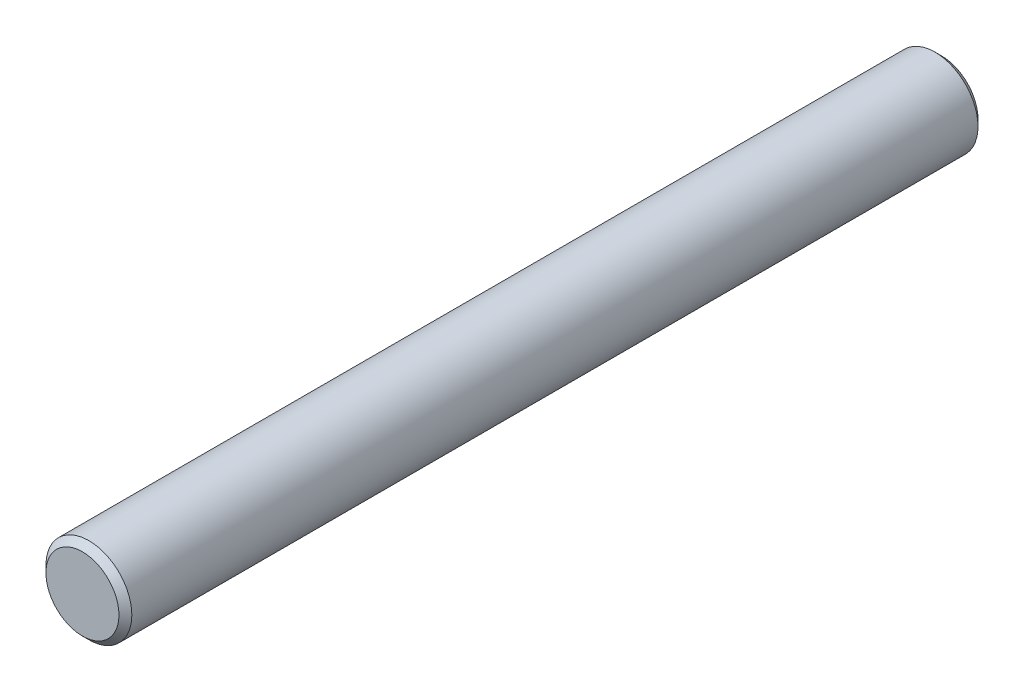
ISO-10303-21;
HEADER;
FILE_DESCRIPTION(('STEP AP214'),'2;1');
FILE_NAME('part.step','',(''),(''),'','','');
FILE_SCHEMA(('AUTOMOTIVE_DESIGN { 1 0 10303 214 1 1 1 1 }'));
ENDSEC;
DATA;
#1=APPLICATION_CONTEXT('core data for automotive mechanical design processes');
#2=APPLICATION_PROTOCOL_DEFINITION('international standard','automotive_design',2000,#1);
#3=PRODUCT_CONTEXT('',#1,'mechanical');
#4=PRODUCT('Part','Part','',(#3));
#5=PRODUCT_RELATED_PRODUCT_CATEGORY('part','',(#4));
#6=PRODUCT_DEFINITION_FORMATION('','',#4);
#7=PRODUCT_DEFINITION_CONTEXT('part definition',#1,'design');
#8=PRODUCT_DEFINITION('design','',#6,#7);
#9=PRODUCT_DEFINITION_SHAPE('','',#8);
#10=(LENGTH_UNIT() NAMED_UNIT(*) SI_UNIT(.MILLI.,.METRE.));
#11=(NAMED_UNIT(*) PLANE_ANGLE_UNIT() SI_UNIT($,.RADIAN.));
#12=(NAMED_UNIT(*) SI_UNIT($,.STERADIAN.) SOLID_ANGLE_UNIT());
#13=UNCERTAINTY_MEASURE_WITH_UNIT(LENGTH_MEASURE(1.E-05),#10,'distance_accuracy_value','');
#14=(GEOMETRIC_REPRESENTATION_CONTEXT(3) GLOBAL_UNCERTAINTY_ASSIGNED_CONTEXT((#13)) GLOBAL_UNIT_ASSIGNED_CONTEXT((#10,
#11,#12)) REPRESENTATION_CONTEXT('',''));
#15=CARTESIAN_POINT('',(0.,0.,0.));
#16=DIRECTION('',(0.,0.,1.));
#17=DIRECTION('',(1.,0.,0.));
#18=AXIS2_PLACEMENT_3D('',#15,#16,#17);
#19=CARTESIAN_POINT('',(0.,0.,20.));
#20=DIRECTION('',(0.,0.,-1.));
#21=DIRECTION('',(-1.,0.,0.));
#22=AXIS2_PLACEMENT_3D('',#19,#20,#21);
#23=CYLINDRICAL_SURFACE('',#22,1.);
#24=CARTESIAN_POINT('',(0.,0.,0.150000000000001));
#25=DIRECTION('',(0.,0.,1.));
#26=DIRECTION('',(1.,0.,0.));
#27=AXIS2_PLACEMENT_3D('',#24,#25,#26);
#28=CIRCLE('',#27,1.);
#29=CARTESIAN_POINT('',(1.,0.,0.150000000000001));
#30=VERTEX_POINT('',#29);
#31=EDGE_CURVE('E39',#30,#30,#28,.T.);
#32=ORIENTED_EDGE('',*,*,#31,.T.);
#33=EDGE_LOOP('',(#32));
#34=FACE_BOUND('',#33,.T.);
#35=CARTESIAN_POINT('',(0.,0.,19.85));
#36=DIRECTION('',(0.,0.,1.));
#37=DIRECTION('',(1.,0.,0.));
#38=AXIS2_PLACEMENT_3D('',#35,#36,#37);
#39=CIRCLE('',#38,1.);
#40=CARTESIAN_POINT('',(1.,0.,19.85));
#41=VERTEX_POINT('',#40);
#42=EDGE_CURVE('E43',#41,#41,#39,.F.);
#43=ORIENTED_EDGE('',*,*,#42,.T.);
#44=EDGE_LOOP('',(#43));
#45=FACE_BOUND('',#44,.T.);
#46=ADVANCED_FACE('F28',(#34,#45),#23,.T.);
#47=CARTESIAN_POINT('',(0.,0.,20.));
#48=DIRECTION('',(0.,0.,1.));
#49=DIRECTION('',(1.,0.,0.));
#50=AXIS2_PLACEMENT_3D('',#47,#48,#49);
#51=PLANE('',#50);
#52=CARTESIAN_POINT('',(0.,0.,20.));
#53=DIRECTION('',(0.,0.,1.));
#54=DIRECTION('',(1.,0.,0.));
#55=AXIS2_PLACEMENT_3D('',#52,#53,#54);
#56=CIRCLE('',#55,0.849999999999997);
#57=CARTESIAN_POINT('',(0.849999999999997,0.,20.));
#58=VERTEX_POINT('',#57);
#59=EDGE_CURVE('E10',#58,#58,#56,.T.);
#60=ORIENTED_EDGE('',*,*,#59,.T.);
#61=EDGE_LOOP('',(#60));
#62=FACE_BOUND('',#61,.T.);
#63=ADVANCED_FACE('F59',(#62),#51,.T.);
#64=CARTESIAN_POINT('',(0.,0.,0.));
#65=DIRECTION('',(0.,0.,1.));
#66=DIRECTION('',(1.,0.,0.));
#67=AXIS2_PLACEMENT_3D('',#64,#65,#66);
#68=PLANE('',#67);
#69=CARTESIAN_POINT('',(0.,0.,0.));
#70=DIRECTION('',(0.,0.,1.));
#71=DIRECTION('',(1.,0.,0.));
#72=AXIS2_PLACEMENT_3D('',#69,#70,#71);
#73=CIRCLE('',#72,0.849999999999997);
#74=CARTESIAN_POINT('',(0.849999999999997,0.,0.));
#75=VERTEX_POINT('',#74);
#76=EDGE_CURVE('E35',#75,#75,#73,.F.);
#77=ORIENTED_EDGE('',*,*,#76,.T.);
#78=EDGE_LOOP('',(#77));
#79=FACE_BOUND('',#78,.T.);
#80=ADVANCED_FACE('F56',(#79),#68,.F.);
#81=CARTESIAN_POINT('',(0.,0.,0.150000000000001));
#82=DIRECTION('',(0.,0.,1.));
#83=DIRECTION('',(1.,0.,0.));
#84=AXIS2_PLACEMENT_3D('',#81,#82,#83);
#85=CONICAL_SURFACE('',#84,1.,0.785398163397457);
#86=ORIENTED_EDGE('',*,*,#76,.F.);
#87=EDGE_LOOP('',(#86));
#88=FACE_BOUND('',#87,.T.);
#89=ORIENTED_EDGE('',*,*,#31,.F.);
#90=EDGE_LOOP('',(#89));
#91=FACE_BOUND('',#90,.T.);
#92=ADVANCED_FACE('F52',(#88,#91),#85,.T.);
#93=CARTESIAN_POINT('',(0.,0.,20.));
#94=DIRECTION('',(0.,0.,-1.));
#95=DIRECTION('',(-1.,0.,0.));
#96=AXIS2_PLACEMENT_3D('',#93,#94,#95);
#97=CONICAL_SURFACE('',#96,0.849999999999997,0.785398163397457);
#98=ORIENTED_EDGE('',*,*,#42,.F.);
#99=EDGE_LOOP('',(#98));
#100=FACE_BOUND('',#99,.T.);
#101=ORIENTED_EDGE('',*,*,#59,.F.);
#102=EDGE_LOOP('',(#101));
#103=FACE_BOUND('',#102,.T.);
#104=ADVANCED_FACE('F30',(#100,#103),#97,.T.);
#105=CLOSED_SHELL('',(#46,#63,#80,#92,#104));
#106=MANIFOLD_SOLID_BREP('B2',#105);
#107=ADVANCED_BREP_SHAPE_REPRESENTATION('',(#18,#106),#14);
#108=SHAPE_DEFINITION_REPRESENTATION(#9,#107);
ENDSEC;
END-ISO-10303-21;
